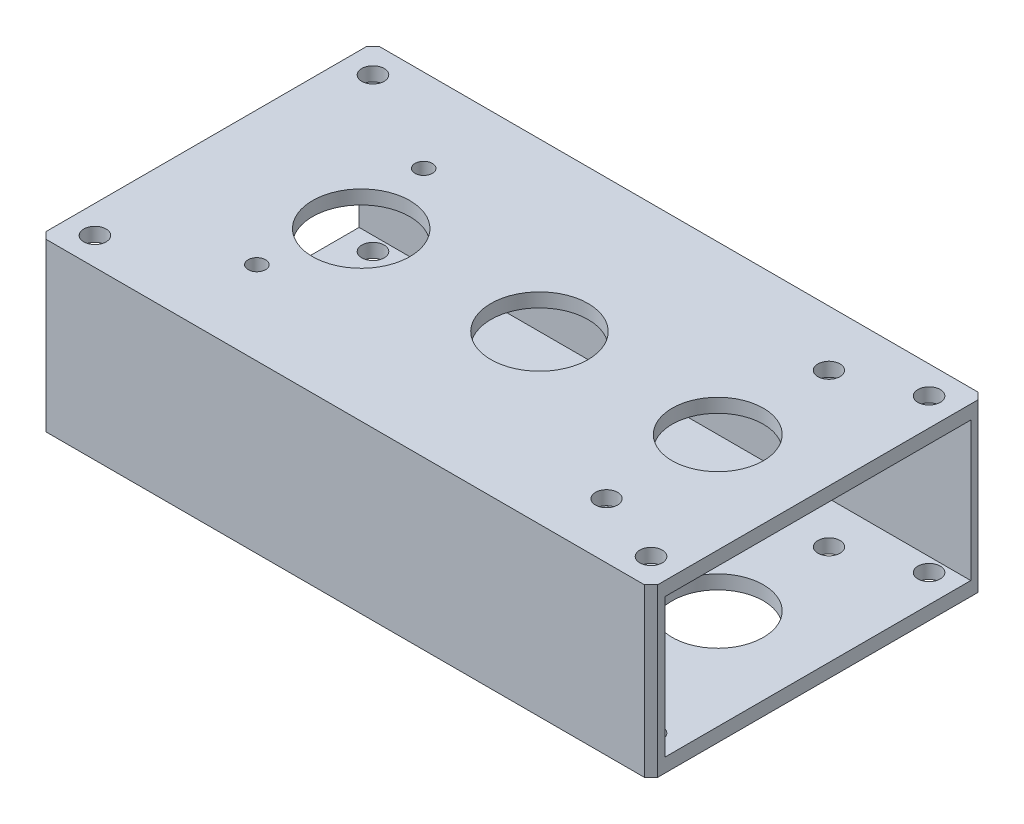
ISO-10303-21;
HEADER;
FILE_DESCRIPTION(('STEP AP214'),'2;1');
FILE_NAME('part.step','',(''),(''),'','','');
FILE_SCHEMA(('AUTOMOTIVE_DESIGN { 1 0 10303 214 1 1 1 1 }'));
ENDSEC;
DATA;
#1=APPLICATION_CONTEXT('core data for automotive mechanical design processes');
#2=APPLICATION_PROTOCOL_DEFINITION('international standard','automotive_design',2000,#1);
#3=PRODUCT_CONTEXT('',#1,'mechanical');
#4=PRODUCT('Part','Part','',(#3));
#5=PRODUCT_RELATED_PRODUCT_CATEGORY('part','',(#4));
#6=PRODUCT_DEFINITION_FORMATION('','',#4);
#7=PRODUCT_DEFINITION_CONTEXT('part definition',#1,'design');
#8=PRODUCT_DEFINITION('design','',#6,#7);
#9=PRODUCT_DEFINITION_SHAPE('','',#8);
#10=(LENGTH_UNIT() NAMED_UNIT(*) SI_UNIT(.MILLI.,.METRE.));
#11=(NAMED_UNIT(*) PLANE_ANGLE_UNIT() SI_UNIT($,.RADIAN.));
#12=(NAMED_UNIT(*) SI_UNIT($,.STERADIAN.) SOLID_ANGLE_UNIT());
#13=UNCERTAINTY_MEASURE_WITH_UNIT(LENGTH_MEASURE(1.E-05),#10,'distance_accuracy_value','');
#14=(GEOMETRIC_REPRESENTATION_CONTEXT(3) GLOBAL_UNCERTAINTY_ASSIGNED_CONTEXT((#13)) GLOBAL_UNIT_ASSIGNED_CONTEXT((#10,
#11,#12)) REPRESENTATION_CONTEXT('',''));
#15=CARTESIAN_POINT('',(0.,0.,0.));
#16=DIRECTION('',(0.,0.,1.));
#17=DIRECTION('',(1.,0.,0.));
#18=AXIS2_PLACEMENT_3D('',#15,#16,#17);
#19=CARTESIAN_POINT('',(30.6324,144.578053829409,-19.05));
#20=DIRECTION('',(0.,1.,0.));
#21=DIRECTION('',(0.,0.,1.));
#22=AXIS2_PLACEMENT_3D('',#19,#20,#21);
#23=CYLINDRICAL_SURFACE('',#22,1.98374);
#24=CARTESIAN_POINT('',(30.6324,-19.05,-19.05));
#25=DIRECTION('',(0.,1.,0.));
#26=DIRECTION('',(0.,0.,1.));
#27=AXIS2_PLACEMENT_3D('',#24,#25,#26);
#28=CIRCLE('',#27,1.98374);
#29=CARTESIAN_POINT('',(30.6324,-19.05,-17.06626));
#30=VERTEX_POINT('',#29);
#31=EDGE_CURVE('E146',#30,#30,#28,.T.);
#32=ORIENTED_EDGE('',*,*,#31,.F.);
#33=EDGE_LOOP('',(#32));
#34=FACE_BOUND('',#33,.T.);
#35=CARTESIAN_POINT('',(30.6324,-15.875,-19.05));
#36=DIRECTION('',(0.,1.,0.));
#37=DIRECTION('',(0.,0.,1.));
#38=AXIS2_PLACEMENT_3D('',#35,#36,#37);
#39=CIRCLE('',#38,1.98374);
#40=CARTESIAN_POINT('',(30.6324,-15.875,-17.06626));
#41=VERTEX_POINT('',#40);
#42=EDGE_CURVE('E20',#41,#41,#39,.T.);
#43=ORIENTED_EDGE('',*,*,#42,.T.);
#44=EDGE_LOOP('',(#43));
#45=FACE_BOUND('',#44,.T.);
#46=ADVANCED_FACE('F17',(#34,#45),#23,.F.);
#47=CARTESIAN_POINT('',(116.84,-144.578053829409,0.));
#48=DIRECTION('',(0.,-1.,0.));
#49=DIRECTION('',(0.,0.,-1.));
#50=AXIS2_PLACEMENT_3D('',#47,#48,#49);
#51=CYLINDRICAL_SURFACE('',#50,10.414);
#52=CARTESIAN_POINT('',(116.84,-19.05,0.));
#53=DIRECTION('',(0.,-1.,0.));
#54=DIRECTION('',(0.,0.,-1.));
#55=AXIS2_PLACEMENT_3D('',#52,#53,#54);
#56=CIRCLE('',#55,10.414);
#57=CARTESIAN_POINT('',(116.84,-19.05,-10.414));
#58=VERTEX_POINT('',#57);
#59=EDGE_CURVE('E241',#58,#58,#56,.F.);
#60=ORIENTED_EDGE('',*,*,#59,.F.);
#61=EDGE_LOOP('',(#60));
#62=FACE_BOUND('',#61,.T.);
#63=CARTESIAN_POINT('',(116.84,-15.875,0.));
#64=DIRECTION('',(0.,-1.,0.));
#65=DIRECTION('',(0.,0.,-1.));
#66=AXIS2_PLACEMENT_3D('',#63,#64,#65);
#67=CIRCLE('',#66,10.414);
#68=CARTESIAN_POINT('',(116.84,-15.875,-10.414));
#69=VERTEX_POINT('',#68);
#70=EDGE_CURVE('E269',#69,#69,#67,.F.);
#71=ORIENTED_EDGE('',*,*,#70,.T.);
#72=EDGE_LOOP('',(#71));
#73=FACE_BOUND('',#72,.T.);
#74=ADVANCED_FACE('F411',(#62,#73),#51,.F.);
#75=CARTESIAN_POINT('',(6.35000000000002,-144.578053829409,31.75));
#76=DIRECTION('',(0.,-1.,0.));
#77=DIRECTION('',(0.,0.,-1.));
#78=AXIS2_PLACEMENT_3D('',#75,#76,#77);
#79=CYLINDRICAL_SURFACE('',#78,2.5527);
#80=CARTESIAN_POINT('',(6.35000000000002,-19.05,31.75));
#81=DIRECTION('',(0.,-1.,0.));
#82=DIRECTION('',(0.,0.,-1.));
#83=AXIS2_PLACEMENT_3D('',#80,#81,#82);
#84=CIRCLE('',#83,2.5527);
#85=CARTESIAN_POINT('',(6.35000000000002,-19.05,29.1973));
#86=VERTEX_POINT('',#85);
#87=EDGE_CURVE('E238',#86,#86,#84,.F.);
#88=ORIENTED_EDGE('',*,*,#87,.F.);
#89=EDGE_LOOP('',(#88));
#90=FACE_BOUND('',#89,.T.);
#91=CARTESIAN_POINT('',(6.35000000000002,-15.875,31.75));
#92=DIRECTION('',(0.,-1.,0.));
#93=DIRECTION('',(0.,0.,-1.));
#94=AXIS2_PLACEMENT_3D('',#91,#92,#93);
#95=CIRCLE('',#94,2.5527);
#96=CARTESIAN_POINT('',(6.35000000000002,-15.875,29.1973));
#97=VERTEX_POINT('',#96);
#98=EDGE_CURVE('E267',#97,#97,#95,.F.);
#99=ORIENTED_EDGE('',*,*,#98,.T.);
#100=EDGE_LOOP('',(#99));
#101=FACE_BOUND('',#100,.T.);
#102=ADVANCED_FACE('F415',(#90,#101),#79,.F.);
#103=CARTESIAN_POINT('',(133.35,-144.578053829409,-31.75));
#104=DIRECTION('',(0.,-1.,0.));
#105=DIRECTION('',(0.,0.,-1.));
#106=AXIS2_PLACEMENT_3D('',#103,#104,#105);
#107=CYLINDRICAL_SURFACE('',#106,2.5527);
#108=CARTESIAN_POINT('',(133.35,-19.05,-31.75));
#109=DIRECTION('',(0.,-1.,0.));
#110=DIRECTION('',(0.,0.,-1.));
#111=AXIS2_PLACEMENT_3D('',#108,#109,#110);
#112=CIRCLE('',#111,2.5527);
#113=CARTESIAN_POINT('',(133.35,-19.05,-34.3027));
#114=VERTEX_POINT('',#113);
#115=EDGE_CURVE('E235',#114,#114,#112,.F.);
#116=ORIENTED_EDGE('',*,*,#115,.F.);
#117=EDGE_LOOP('',(#116));
#118=FACE_BOUND('',#117,.T.);
#119=CARTESIAN_POINT('',(133.35,-15.875,-31.75));
#120=DIRECTION('',(0.,-1.,0.));
#121=DIRECTION('',(0.,0.,-1.));
#122=AXIS2_PLACEMENT_3D('',#119,#120,#121);
#123=CIRCLE('',#122,2.5527);
#124=CARTESIAN_POINT('',(133.35,-15.875,-34.3027));
#125=VERTEX_POINT('',#124);
#126=EDGE_CURVE('E264',#125,#125,#123,.F.);
#127=ORIENTED_EDGE('',*,*,#126,.T.);
#128=EDGE_LOOP('',(#127));
#129=FACE_BOUND('',#128,.T.);
#130=ADVANCED_FACE('F420',(#118,#129),#107,.F.);
#131=CARTESIAN_POINT('',(76.1238,-144.578053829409,0.));
#132=DIRECTION('',(0.,-1.,0.));
#133=DIRECTION('',(0.,0.,-1.));
#134=AXIS2_PLACEMENT_3D('',#131,#132,#133);
#135=CYLINDRICAL_SURFACE('',#134,11.10615);
#136=CARTESIAN_POINT('',(76.1238,-19.05,0.));
#137=DIRECTION('',(0.,-1.,0.));
#138=DIRECTION('',(0.,0.,-1.));
#139=AXIS2_PLACEMENT_3D('',#136,#137,#138);
#140=CIRCLE('',#139,11.10615);
#141=CARTESIAN_POINT('',(76.1238,-19.05,-11.10615));
#142=VERTEX_POINT('',#141);
#143=EDGE_CURVE('E232',#142,#142,#140,.F.);
#144=ORIENTED_EDGE('',*,*,#143,.F.);
#145=EDGE_LOOP('',(#144));
#146=FACE_BOUND('',#145,.T.);
#147=CARTESIAN_POINT('',(76.1238,-15.875,0.));
#148=DIRECTION('',(0.,-1.,0.));
#149=DIRECTION('',(0.,0.,-1.));
#150=AXIS2_PLACEMENT_3D('',#147,#148,#149);
#151=CIRCLE('',#150,11.10615);
#152=CARTESIAN_POINT('',(76.1238,-15.875,-11.10615));
#153=VERTEX_POINT('',#152);
#154=EDGE_CURVE('E261',#153,#153,#151,.F.);
#155=ORIENTED_EDGE('',*,*,#154,.T.);
#156=EDGE_LOOP('',(#155));
#157=FACE_BOUND('',#156,.T.);
#158=ADVANCED_FACE('F426',(#146,#157),#135,.F.);
#159=CARTESIAN_POINT('',(116.84,-144.578053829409,-25.4));
#160=DIRECTION('',(0.,-1.,0.));
#161=DIRECTION('',(0.,0.,-1.));
#162=AXIS2_PLACEMENT_3D('',#159,#160,#161);
#163=CYLINDRICAL_SURFACE('',#162,2.5273);
#164=CARTESIAN_POINT('',(116.84,-19.05,-25.4));
#165=DIRECTION('',(0.,-1.,0.));
#166=DIRECTION('',(0.,0.,-1.));
#167=AXIS2_PLACEMENT_3D('',#164,#165,#166);
#168=CIRCLE('',#167,2.5273);
#169=CARTESIAN_POINT('',(116.84,-19.05,-27.9273));
#170=VERTEX_POINT('',#169);
#171=EDGE_CURVE('E229',#170,#170,#168,.F.);
#172=ORIENTED_EDGE('',*,*,#171,.F.);
#173=EDGE_LOOP('',(#172));
#174=FACE_BOUND('',#173,.T.);
#175=CARTESIAN_POINT('',(116.84,-15.875,-25.4));
#176=DIRECTION('',(0.,-1.,0.));
#177=DIRECTION('',(0.,0.,-1.));
#178=AXIS2_PLACEMENT_3D('',#175,#176,#177);
#179=CIRCLE('',#178,2.5273);
#180=CARTESIAN_POINT('',(116.84,-15.875,-27.9273));
#181=VERTEX_POINT('',#180);
#182=EDGE_CURVE('E150',#181,#181,#179,.F.);
#183=ORIENTED_EDGE('',*,*,#182,.T.);
#184=EDGE_LOOP('',(#183));
#185=FACE_BOUND('',#184,.T.);
#186=ADVANCED_FACE('F430',(#174,#185),#163,.F.);
#187=CARTESIAN_POINT('',(116.84,-144.578053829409,25.4));
#188=DIRECTION('',(0.,-1.,0.));
#189=DIRECTION('',(0.,0.,-1.));
#190=AXIS2_PLACEMENT_3D('',#187,#188,#189);
#191=CYLINDRICAL_SURFACE('',#190,2.5273);
#192=CARTESIAN_POINT('',(116.84,-19.05,25.4));
#193=DIRECTION('',(0.,-1.,0.));
#194=DIRECTION('',(0.,0.,-1.));
#195=AXIS2_PLACEMENT_3D('',#192,#193,#194);
#196=CIRCLE('',#195,2.5273);
#197=CARTESIAN_POINT('',(116.84,-19.05,22.8727));
#198=VERTEX_POINT('',#197);
#199=EDGE_CURVE('E226',#198,#198,#196,.F.);
#200=ORIENTED_EDGE('',*,*,#199,.F.);
#201=EDGE_LOOP('',(#200));
#202=FACE_BOUND('',#201,.T.);
#203=CARTESIAN_POINT('',(116.84,-15.875,25.4));
#204=DIRECTION('',(0.,-1.,0.));
#205=DIRECTION('',(0.,0.,-1.));
#206=AXIS2_PLACEMENT_3D('',#203,#204,#205);
#207=CIRCLE('',#206,2.5273);
#208=CARTESIAN_POINT('',(116.84,-15.875,22.8727));
#209=VERTEX_POINT('',#208);
#210=EDGE_CURVE('E149',#209,#209,#207,.F.);
#211=ORIENTED_EDGE('',*,*,#210,.T.);
#212=EDGE_LOOP('',(#211));
#213=FACE_BOUND('',#212,.T.);
#214=ADVANCED_FACE('F434',(#202,#213),#191,.F.);
#215=CARTESIAN_POINT('',(133.35,-144.578053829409,31.75));
#216=DIRECTION('',(0.,-1.,0.));
#217=DIRECTION('',(0.,0.,-1.));
#218=AXIS2_PLACEMENT_3D('',#215,#216,#217);
#219=CYLINDRICAL_SURFACE('',#218,2.5527);
#220=CARTESIAN_POINT('',(133.35,-19.05,31.75));
#221=DIRECTION('',(0.,-1.,0.));
#222=DIRECTION('',(0.,0.,-1.));
#223=AXIS2_PLACEMENT_3D('',#220,#221,#222);
#224=CIRCLE('',#223,2.5527);
#225=CARTESIAN_POINT('',(133.35,-19.05,29.1973));
#226=VERTEX_POINT('',#225);
#227=EDGE_CURVE('E223',#226,#226,#224,.F.);
#228=ORIENTED_EDGE('',*,*,#227,.F.);
#229=EDGE_LOOP('',(#228));
#230=FACE_BOUND('',#229,.T.);
#231=CARTESIAN_POINT('',(133.35,-15.875,31.75));
#232=DIRECTION('',(0.,-1.,0.));
#233=DIRECTION('',(0.,0.,-1.));
#234=AXIS2_PLACEMENT_3D('',#231,#232,#233);
#235=CIRCLE('',#234,2.5527);
#236=CARTESIAN_POINT('',(133.35,-15.875,29.1973));
#237=VERTEX_POINT('',#236);
#238=EDGE_CURVE('E254',#237,#237,#235,.F.);
#239=ORIENTED_EDGE('',*,*,#238,.T.);
#240=EDGE_LOOP('',(#239));
#241=FACE_BOUND('',#240,.T.);
#242=ADVANCED_FACE('F438',(#230,#241),#219,.F.);
#243=CARTESIAN_POINT('',(6.34999999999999,-144.578053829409,-31.75));
#244=DIRECTION('',(0.,-1.,0.));
#245=DIRECTION('',(0.,0.,-1.));
#246=AXIS2_PLACEMENT_3D('',#243,#244,#245);
#247=CYLINDRICAL_SURFACE('',#246,2.5527);
#248=CARTESIAN_POINT('',(6.34999999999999,-19.05,-31.75));
#249=DIRECTION('',(0.,-1.,0.));
#250=DIRECTION('',(0.,0.,-1.));
#251=AXIS2_PLACEMENT_3D('',#248,#249,#250);
#252=CIRCLE('',#251,2.5527);
#253=CARTESIAN_POINT('',(6.34999999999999,-19.05,-34.3027));
#254=VERTEX_POINT('',#253);
#255=EDGE_CURVE('E220',#254,#254,#252,.F.);
#256=ORIENTED_EDGE('',*,*,#255,.F.);
#257=EDGE_LOOP('',(#256));
#258=FACE_BOUND('',#257,.T.);
#259=CARTESIAN_POINT('',(6.34999999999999,-15.875,-31.75));
#260=DIRECTION('',(0.,-1.,0.));
#261=DIRECTION('',(0.,0.,-1.));
#262=AXIS2_PLACEMENT_3D('',#259,#260,#261);
#263=CIRCLE('',#262,2.5527);
#264=CARTESIAN_POINT('',(6.34999999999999,-15.875,-34.3027));
#265=VERTEX_POINT('',#264);
#266=EDGE_CURVE('E251',#265,#265,#263,.F.);
#267=ORIENTED_EDGE('',*,*,#266,.T.);
#268=EDGE_LOOP('',(#267));
#269=FACE_BOUND('',#268,.T.);
#270=ADVANCED_FACE('F442',(#258,#269),#247,.F.);
#271=CARTESIAN_POINT('',(35.4076,144.578053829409,0.));
#272=DIRECTION('',(0.,1.,0.));
#273=DIRECTION('',(0.,0.,1.));
#274=AXIS2_PLACEMENT_3D('',#271,#272,#273);
#275=CYLINDRICAL_SURFACE('',#274,14.28115);
#276=CARTESIAN_POINT('',(35.4076,-19.05,0.));
#277=DIRECTION('',(0.,1.,0.));
#278=DIRECTION('',(0.,0.,1.));
#279=AXIS2_PLACEMENT_3D('',#276,#277,#278);
#280=CIRCLE('',#279,14.28115);
#281=CARTESIAN_POINT('',(35.4076,-19.05,14.28115));
#282=VERTEX_POINT('',#281);
#283=EDGE_CURVE('E217',#282,#282,#280,.T.);
#284=ORIENTED_EDGE('',*,*,#283,.F.);
#285=EDGE_LOOP('',(#284));
#286=FACE_BOUND('',#285,.T.);
#287=CARTESIAN_POINT('',(35.4076,-15.875,0.));
#288=DIRECTION('',(0.,1.,0.));
#289=DIRECTION('',(0.,0.,1.));
#290=AXIS2_PLACEMENT_3D('',#287,#288,#289);
#291=CIRCLE('',#290,14.28115);
#292=CARTESIAN_POINT('',(35.4076,-15.875,14.28115));
#293=VERTEX_POINT('',#292);
#294=EDGE_CURVE('E248',#293,#293,#291,.T.);
#295=ORIENTED_EDGE('',*,*,#294,.T.);
#296=EDGE_LOOP('',(#295));
#297=FACE_BOUND('',#296,.T.);
#298=ADVANCED_FACE('F446',(#286,#297),#275,.F.);
#299=CARTESIAN_POINT('',(30.6324,144.578053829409,19.05));
#300=DIRECTION('',(0.,1.,0.));
#301=DIRECTION('',(0.,0.,1.));
#302=AXIS2_PLACEMENT_3D('',#299,#300,#301);
#303=CYLINDRICAL_SURFACE('',#302,1.98374);
#304=CARTESIAN_POINT('',(30.6324,-19.05,19.05));
#305=DIRECTION('',(0.,1.,0.));
#306=DIRECTION('',(0.,0.,1.));
#307=AXIS2_PLACEMENT_3D('',#304,#305,#306);
#308=CIRCLE('',#307,1.98374);
#309=CARTESIAN_POINT('',(30.6324,-19.05,21.03374));
#310=VERTEX_POINT('',#309);
#311=EDGE_CURVE('E143',#310,#310,#308,.T.);
#312=ORIENTED_EDGE('',*,*,#311,.F.);
#313=EDGE_LOOP('',(#312));
#314=FACE_BOUND('',#313,.T.);
#315=CARTESIAN_POINT('',(30.6324,-15.875,19.05));
#316=DIRECTION('',(0.,1.,0.));
#317=DIRECTION('',(0.,0.,1.));
#318=AXIS2_PLACEMENT_3D('',#315,#316,#317);
#319=CIRCLE('',#318,1.98374);
#320=CARTESIAN_POINT('',(30.6324,-15.875,21.03374));
#321=VERTEX_POINT('',#320);
#322=EDGE_CURVE('E147',#321,#321,#319,.T.);
#323=ORIENTED_EDGE('',*,*,#322,.T.);
#324=EDGE_LOOP('',(#323));
#325=FACE_BOUND('',#324,.T.);
#326=ADVANCED_FACE('F289',(#314,#325),#303,.F.);
#327=CARTESIAN_POINT('',(139.7,-15.875,34.925));
#328=DIRECTION('',(0.,0.,1.));
#329=DIRECTION('',(0.,-1.,0.));
#330=AXIS2_PLACEMENT_3D('',#327,#328,#329);
#331=PLANE('',#330);
#332=DIRECTION('',(1.,0.,0.));
#333=VECTOR('',#332,1.);
#334=CARTESIAN_POINT('',(139.7,15.875,34.925));
#335=LINE('',#334,#333);
#336=CARTESIAN_POINT('',(0.,15.875,34.925));
#337=VERTEX_POINT('',#336);
#338=CARTESIAN_POINT('',(139.7,15.875,34.925));
#339=VERTEX_POINT('',#338);
#340=EDGE_CURVE('E116',#337,#339,#335,.T.);
#341=ORIENTED_EDGE('',*,*,#340,.T.);
#342=DIRECTION('',(0.,-1.,0.));
#343=VECTOR('',#342,1.);
#344=CARTESIAN_POINT('',(139.7,-19.05,34.925));
#345=LINE('',#344,#343);
#346=CARTESIAN_POINT('',(139.7,-15.875,34.925));
#347=VERTEX_POINT('',#346);
#348=EDGE_CURVE('E620',#339,#347,#345,.T.);
#349=ORIENTED_EDGE('',*,*,#348,.T.);
#350=DIRECTION('',(1.,0.,0.));
#351=VECTOR('',#350,1.);
#352=CARTESIAN_POINT('',(139.7,-15.875,34.925));
#353=LINE('',#352,#351);
#354=CARTESIAN_POINT('',(0.,-15.875,34.925));
#355=VERTEX_POINT('',#354);
#356=EDGE_CURVE('E148',#347,#355,#353,.F.);
#357=ORIENTED_EDGE('',*,*,#356,.T.);
#358=DIRECTION('',(0.,-1.,0.));
#359=VECTOR('',#358,1.);
#360=CARTESIAN_POINT('',(0.,-19.05,34.925));
#361=LINE('',#360,#359);
#362=EDGE_CURVE('E125',#337,#355,#361,.T.);
#363=ORIENTED_EDGE('',*,*,#362,.F.);
#364=EDGE_LOOP('',(#341,#349,#357,#363));
#365=FACE_BOUND('',#364,.T.);
#366=ADVANCED_FACE('F279',(#365),#331,.F.);
#367=CARTESIAN_POINT('',(139.7,-15.875,-34.925));
#368=DIRECTION('',(0.,-1.,0.));
#369=DIRECTION('',(0.,0.,-1.));
#370=AXIS2_PLACEMENT_3D('',#367,#368,#369);
#371=PLANE('',#370);
#372=ORIENTED_EDGE('',*,*,#322,.F.);
#373=EDGE_LOOP('',(#372));
#374=FACE_BOUND('',#373,.T.);
#375=ORIENTED_EDGE('',*,*,#294,.F.);
#376=EDGE_LOOP('',(#375));
#377=FACE_BOUND('',#376,.T.);
#378=ORIENTED_EDGE('',*,*,#266,.F.);
#379=EDGE_LOOP('',(#378));
#380=FACE_BOUND('',#379,.T.);
#381=ORIENTED_EDGE('',*,*,#238,.F.);
#382=EDGE_LOOP('',(#381));
#383=FACE_BOUND('',#382,.T.);
#384=ORIENTED_EDGE('',*,*,#210,.F.);
#385=EDGE_LOOP('',(#384));
#386=FACE_BOUND('',#385,.T.);
#387=ORIENTED_EDGE('',*,*,#356,.F.);
#388=DIRECTION('',(0.,0.,1.));
#389=VECTOR('',#388,1.);
#390=CARTESIAN_POINT('',(139.7,-15.875,38.1));
#391=LINE('',#390,#389);
#392=CARTESIAN_POINT('',(139.7,-15.875,-34.925));
#393=VERTEX_POINT('',#392);
#394=EDGE_CURVE('E617',#347,#393,#391,.F.);
#395=ORIENTED_EDGE('',*,*,#394,.T.);
#396=DIRECTION('',(1.,0.,0.));
#397=VECTOR('',#396,1.);
#398=CARTESIAN_POINT('',(139.7,-15.875,-34.925));
#399=LINE('',#398,#397);
#400=CARTESIAN_POINT('',(0.,-15.875,-34.925));
#401=VERTEX_POINT('',#400);
#402=EDGE_CURVE('E144',#393,#401,#399,.F.);
#403=ORIENTED_EDGE('',*,*,#402,.T.);
#404=DIRECTION('',(0.,0.,1.));
#405=VECTOR('',#404,1.);
#406=CARTESIAN_POINT('',(0.,-15.875,38.1));
#407=LINE('',#406,#405);
#408=EDGE_CURVE('E129',#355,#401,#407,.F.);
#409=ORIENTED_EDGE('',*,*,#408,.F.);
#410=EDGE_LOOP('',(#387,#395,#403,#409));
#411=FACE_BOUND('',#410,.T.);
#412=ORIENTED_EDGE('',*,*,#182,.F.);
#413=EDGE_LOOP('',(#412));
#414=FACE_BOUND('',#413,.T.);
#415=ORIENTED_EDGE('',*,*,#154,.F.);
#416=EDGE_LOOP('',(#415));
#417=FACE_BOUND('',#416,.T.);
#418=ORIENTED_EDGE('',*,*,#126,.F.);
#419=EDGE_LOOP('',(#418));
#420=FACE_BOUND('',#419,.T.);
#421=ORIENTED_EDGE('',*,*,#98,.F.);
#422=EDGE_LOOP('',(#421));
#423=FACE_BOUND('',#422,.T.);
#424=ORIENTED_EDGE('',*,*,#70,.F.);
#425=EDGE_LOOP('',(#424));
#426=FACE_BOUND('',#425,.T.);
#427=ORIENTED_EDGE('',*,*,#42,.F.);
#428=EDGE_LOOP('',(#427));
#429=FACE_BOUND('',#428,.T.);
#430=ADVANCED_FACE('F277',(#374,#377,#380,#383,#386,#411,#414,#417,#420,#423,#426,#429),#371,.F.);
#431=CARTESIAN_POINT('',(139.7,15.875,-34.925));
#432=DIRECTION('',(0.,0.,-1.));
#433=DIRECTION('',(0.,1.,0.));
#434=AXIS2_PLACEMENT_3D('',#431,#432,#433);
#435=PLANE('',#434);
#436=ORIENTED_EDGE('',*,*,#402,.F.);
#437=DIRECTION('',(0.,-1.,0.));
#438=VECTOR('',#437,1.);
#439=CARTESIAN_POINT('',(139.7,-19.05,-34.925));
#440=LINE('',#439,#438);
#441=CARTESIAN_POINT('',(139.7,15.875,-34.925));
#442=VERTEX_POINT('',#441);
#443=EDGE_CURVE('E111',#393,#442,#440,.F.);
#444=ORIENTED_EDGE('',*,*,#443,.T.);
#445=DIRECTION('',(1.,0.,0.));
#446=VECTOR('',#445,1.);
#447=CARTESIAN_POINT('',(139.7,15.875,-34.925));
#448=LINE('',#447,#446);
#449=CARTESIAN_POINT('',(0.,15.875,-34.925));
#450=VERTEX_POINT('',#449);
#451=EDGE_CURVE('E103',#442,#450,#448,.F.);
#452=ORIENTED_EDGE('',*,*,#451,.T.);
#453=DIRECTION('',(0.,-1.,0.));
#454=VECTOR('',#453,1.);
#455=CARTESIAN_POINT('',(0.,-19.05,-34.925));
#456=LINE('',#455,#454);
#457=EDGE_CURVE('E108',#401,#450,#456,.F.);
#458=ORIENTED_EDGE('',*,*,#457,.F.);
#459=EDGE_LOOP('',(#436,#444,#452,#458));
#460=FACE_BOUND('',#459,.T.);
#461=ADVANCED_FACE('F106',(#460),#435,.F.);
#462=CARTESIAN_POINT('',(139.7,-19.05,-38.1));
#463=DIRECTION('',(0.,-1.,0.));
#464=DIRECTION('',(0.,0.,-1.));
#465=AXIS2_PLACEMENT_3D('',#462,#463,#464);
#466=PLANE('',#465);
#467=ORIENTED_EDGE('',*,*,#311,.T.);
#468=EDGE_LOOP('',(#467));
#469=FACE_BOUND('',#468,.T.);
#470=ORIENTED_EDGE('',*,*,#283,.T.);
#471=EDGE_LOOP('',(#470));
#472=FACE_BOUND('',#471,.T.);
#473=ORIENTED_EDGE('',*,*,#255,.T.);
#474=EDGE_LOOP('',(#473));
#475=FACE_BOUND('',#474,.T.);
#476=ORIENTED_EDGE('',*,*,#227,.T.);
#477=EDGE_LOOP('',(#476));
#478=FACE_BOUND('',#477,.T.);
#479=ORIENTED_EDGE('',*,*,#199,.T.);
#480=EDGE_LOOP('',(#479));
#481=FACE_BOUND('',#480,.T.);
#482=DIRECTION('',(1.,0.,0.));
#483=VECTOR('',#482,1.);
#484=CARTESIAN_POINT('',(139.7,-19.05,38.1));
#485=LINE('',#484,#483);
#486=CARTESIAN_POINT('',(1.52400000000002,-19.05,38.1));
#487=VERTEX_POINT('',#486);
#488=CARTESIAN_POINT('',(138.176,-19.05,38.1));
#489=VERTEX_POINT('',#488);
#490=EDGE_CURVE('E396',#487,#489,#485,.T.);
#491=ORIENTED_EDGE('',*,*,#490,.F.);
#492=DIRECTION('',(-0.707106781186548,0.,-0.707106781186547));
#493=VECTOR('',#492,1.);
#494=CARTESIAN_POINT('',(0.,-19.05,36.576));
#495=LINE('',#494,#493);
#496=CARTESIAN_POINT('',(0.,-19.05,36.576));
#497=VERTEX_POINT('',#496);
#498=EDGE_CURVE('E638',#487,#497,#495,.T.);
#499=ORIENTED_EDGE('',*,*,#498,.T.);
#500=DIRECTION('',(0.,0.,1.));
#501=VECTOR('',#500,1.);
#502=CARTESIAN_POINT('',(0.,-19.05,38.1));
#503=LINE('',#502,#501);
#504=CARTESIAN_POINT('',(0.,-19.05,-36.576));
#505=VERTEX_POINT('',#504);
#506=EDGE_CURVE('E642',#505,#497,#503,.T.);
#507=ORIENTED_EDGE('',*,*,#506,.F.);
#508=DIRECTION('',(0.707106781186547,0.,-0.707106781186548));
#509=VECTOR('',#508,1.);
#510=CARTESIAN_POINT('',(0.,-19.05,-36.576));
#511=LINE('',#510,#509);
#512=CARTESIAN_POINT('',(1.524,-19.05,-38.1));
#513=VERTEX_POINT('',#512);
#514=EDGE_CURVE('E132',#505,#513,#511,.T.);
#515=ORIENTED_EDGE('',*,*,#514,.T.);
#516=DIRECTION('',(1.,0.,0.));
#517=VECTOR('',#516,1.);
#518=CARTESIAN_POINT('',(139.7,-19.05,-38.1));
#519=LINE('',#518,#517);
#520=CARTESIAN_POINT('',(138.176,-19.05,-38.1));
#521=VERTEX_POINT('',#520);
#522=EDGE_CURVE('E138',#521,#513,#519,.F.);
#523=ORIENTED_EDGE('',*,*,#522,.F.);
#524=DIRECTION('',(-0.707106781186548,0.,-0.707106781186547));
#525=VECTOR('',#524,1.);
#526=CARTESIAN_POINT('',(138.176,-19.05,-38.1));
#527=LINE('',#526,#525);
#528=CARTESIAN_POINT('',(139.7,-19.05,-36.576));
#529=VERTEX_POINT('',#528);
#530=EDGE_CURVE('E674',#529,#521,#527,.T.);
#531=ORIENTED_EDGE('',*,*,#530,.F.);
#532=DIRECTION('',(0.,0.,1.));
#533=VECTOR('',#532,1.);
#534=CARTESIAN_POINT('',(139.7,-19.05,38.1));
#535=LINE('',#534,#533);
#536=CARTESIAN_POINT('',(139.7,-19.05,36.576));
#537=VERTEX_POINT('',#536);
#538=EDGE_CURVE('E678',#529,#537,#535,.T.);
#539=ORIENTED_EDGE('',*,*,#538,.T.);
#540=DIRECTION('',(0.707106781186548,0.,-0.707106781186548));
#541=VECTOR('',#540,1.);
#542=CARTESIAN_POINT('',(138.176,-19.05,38.1));
#543=LINE('',#542,#541);
#544=EDGE_CURVE('E632',#489,#537,#543,.T.);
#545=ORIENTED_EDGE('',*,*,#544,.F.);
#546=EDGE_LOOP('',(#491,#499,#507,#515,#523,#531,#539,#545));
#547=FACE_BOUND('',#546,.T.);
#548=ORIENTED_EDGE('',*,*,#171,.T.);
#549=EDGE_LOOP('',(#548));
#550=FACE_BOUND('',#549,.T.);
#551=ORIENTED_EDGE('',*,*,#143,.T.);
#552=EDGE_LOOP('',(#551));
#553=FACE_BOUND('',#552,.T.);
#554=ORIENTED_EDGE('',*,*,#115,.T.);
#555=EDGE_LOOP('',(#554));
#556=FACE_BOUND('',#555,.T.);
#557=ORIENTED_EDGE('',*,*,#87,.T.);
#558=EDGE_LOOP('',(#557));
#559=FACE_BOUND('',#558,.T.);
#560=ORIENTED_EDGE('',*,*,#59,.T.);
#561=EDGE_LOOP('',(#560));
#562=FACE_BOUND('',#561,.T.);
#563=ORIENTED_EDGE('',*,*,#31,.T.);
#564=EDGE_LOOP('',(#563));
#565=FACE_BOUND('',#564,.T.);
#566=ADVANCED_FACE('F287',(#469,#472,#475,#478,#481,#547,#550,#553,#556,#559,#562,#565),#466,.T.);
#567=CARTESIAN_POINT('',(139.7,15.875,34.925));
#568=DIRECTION('',(0.,1.,0.));
#569=DIRECTION('',(0.,0.,1.));
#570=AXIS2_PLACEMENT_3D('',#567,#568,#569);
#571=PLANE('',#570);
#572=CARTESIAN_POINT('',(6.34999999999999,15.875,-31.75));
#573=DIRECTION('',(0.,-1.,0.));
#574=DIRECTION('',(0.,0.,-1.));
#575=AXIS2_PLACEMENT_3D('',#572,#573,#574);
#576=CIRCLE('',#575,2.5527);
#577=CARTESIAN_POINT('',(6.34999999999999,15.875,-34.3027));
#578=VERTEX_POINT('',#577);
#579=EDGE_CURVE('E183',#578,#578,#576,.F.);
#580=ORIENTED_EDGE('',*,*,#579,.T.);
#581=EDGE_LOOP('',(#580));
#582=FACE_BOUND('',#581,.T.);
#583=CARTESIAN_POINT('',(133.35,15.875,31.75));
#584=DIRECTION('',(0.,-1.,0.));
#585=DIRECTION('',(0.,0.,-1.));
#586=AXIS2_PLACEMENT_3D('',#583,#584,#585);
#587=CIRCLE('',#586,2.5527);
#588=CARTESIAN_POINT('',(133.35,15.875,29.1973));
#589=VERTEX_POINT('',#588);
#590=EDGE_CURVE('E186',#589,#589,#587,.F.);
#591=ORIENTED_EDGE('',*,*,#590,.T.);
#592=EDGE_LOOP('',(#591));
#593=FACE_BOUND('',#592,.T.);
#594=CARTESIAN_POINT('',(116.84,15.875,25.4));
#595=DIRECTION('',(0.,-1.,0.));
#596=DIRECTION('',(0.,0.,-1.));
#597=AXIS2_PLACEMENT_3D('',#594,#595,#596);
#598=CIRCLE('',#597,2.5273);
#599=CARTESIAN_POINT('',(116.84,15.875,22.8727));
#600=VERTEX_POINT('',#599);
#601=EDGE_CURVE('E189',#600,#600,#598,.F.);
#602=ORIENTED_EDGE('',*,*,#601,.T.);
#603=EDGE_LOOP('',(#602));
#604=FACE_BOUND('',#603,.T.);
#605=ORIENTED_EDGE('',*,*,#451,.F.);
#606=DIRECTION('',(0.,0.,1.));
#607=VECTOR('',#606,1.);
#608=CARTESIAN_POINT('',(139.7,15.875,38.1));
#609=LINE('',#608,#607);
#610=EDGE_CURVE('E624',#442,#339,#609,.T.);
#611=ORIENTED_EDGE('',*,*,#610,.T.);
#612=ORIENTED_EDGE('',*,*,#340,.F.);
#613=DIRECTION('',(0.,0.,1.));
#614=VECTOR('',#613,1.);
#615=CARTESIAN_POINT('',(0.,15.875,38.1));
#616=LINE('',#615,#614);
#617=EDGE_CURVE('E119',#450,#337,#616,.T.);
#618=ORIENTED_EDGE('',*,*,#617,.F.);
#619=EDGE_LOOP('',(#605,#611,#612,#618));
#620=FACE_BOUND('',#619,.T.);
#621=CARTESIAN_POINT('',(116.84,15.875,-25.4));
#622=DIRECTION('',(0.,-1.,0.));
#623=DIRECTION('',(0.,0.,-1.));
#624=AXIS2_PLACEMENT_3D('',#621,#622,#623);
#625=CIRCLE('',#624,2.5273);
#626=CARTESIAN_POINT('',(116.84,15.875,-27.9273));
#627=VERTEX_POINT('',#626);
#628=EDGE_CURVE('E140',#627,#627,#625,.F.);
#629=ORIENTED_EDGE('',*,*,#628,.T.);
#630=EDGE_LOOP('',(#629));
#631=FACE_BOUND('',#630,.T.);
#632=CARTESIAN_POINT('',(76.1238,15.875,0.));
#633=DIRECTION('',(0.,-1.,0.));
#634=DIRECTION('',(0.,0.,-1.));
#635=AXIS2_PLACEMENT_3D('',#632,#633,#634);
#636=CIRCLE('',#635,11.10615);
#637=CARTESIAN_POINT('',(76.1238,15.875,-11.10615));
#638=VERTEX_POINT('',#637);
#639=EDGE_CURVE('E195',#638,#638,#636,.F.);
#640=ORIENTED_EDGE('',*,*,#639,.T.);
#641=EDGE_LOOP('',(#640));
#642=FACE_BOUND('',#641,.T.);
#643=CARTESIAN_POINT('',(133.35,15.875,-31.75));
#644=DIRECTION('',(0.,-1.,0.));
#645=DIRECTION('',(0.,0.,-1.));
#646=AXIS2_PLACEMENT_3D('',#643,#644,#645);
#647=CIRCLE('',#646,2.5527);
#648=CARTESIAN_POINT('',(133.35,15.875,-34.3027));
#649=VERTEX_POINT('',#648);
#650=EDGE_CURVE('E198',#649,#649,#647,.F.);
#651=ORIENTED_EDGE('',*,*,#650,.T.);
#652=EDGE_LOOP('',(#651));
#653=FACE_BOUND('',#652,.T.);
#654=CARTESIAN_POINT('',(6.35000000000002,15.875,31.75));
#655=DIRECTION('',(0.,-1.,0.));
#656=DIRECTION('',(0.,0.,-1.));
#657=AXIS2_PLACEMENT_3D('',#654,#655,#656);
#658=CIRCLE('',#657,2.5527);
#659=CARTESIAN_POINT('',(6.35000000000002,15.875,29.1973));
#660=VERTEX_POINT('',#659);
#661=EDGE_CURVE('E201',#660,#660,#658,.F.);
#662=ORIENTED_EDGE('',*,*,#661,.T.);
#663=EDGE_LOOP('',(#662));
#664=FACE_BOUND('',#663,.T.);
#665=CARTESIAN_POINT('',(116.84,15.875,0.));
#666=DIRECTION('',(0.,-1.,0.));
#667=DIRECTION('',(0.,0.,-1.));
#668=AXIS2_PLACEMENT_3D('',#665,#666,#667);
#669=CIRCLE('',#668,10.414);
#670=CARTESIAN_POINT('',(116.84,15.875,-10.414));
#671=VERTEX_POINT('',#670);
#672=EDGE_CURVE('E204',#671,#671,#669,.F.);
#673=ORIENTED_EDGE('',*,*,#672,.T.);
#674=EDGE_LOOP('',(#673));
#675=FACE_BOUND('',#674,.T.);
#676=CARTESIAN_POINT('',(35.4076,15.875,0.));
#677=DIRECTION('',(0.,-1.,0.));
#678=DIRECTION('',(0.,0.,-1.));
#679=AXIS2_PLACEMENT_3D('',#676,#677,#678);
#680=CIRCLE('',#679,11.10615);
#681=CARTESIAN_POINT('',(35.4076,15.875,-11.10615));
#682=VERTEX_POINT('',#681);
#683=EDGE_CURVE('E207',#682,#682,#680,.F.);
#684=ORIENTED_EDGE('',*,*,#683,.T.);
#685=EDGE_LOOP('',(#684));
#686=FACE_BOUND('',#685,.T.);
#687=CARTESIAN_POINT('',(30.6324,15.875,19.05));
#688=DIRECTION('',(0.,-1.,0.));
#689=DIRECTION('',(0.,0.,-1.));
#690=AXIS2_PLACEMENT_3D('',#687,#688,#689);
#691=CIRCLE('',#690,1.98374);
#692=CARTESIAN_POINT('',(30.6324,15.875,17.06626));
#693=VERTEX_POINT('',#692);
#694=EDGE_CURVE('E210',#693,#693,#691,.F.);
#695=ORIENTED_EDGE('',*,*,#694,.T.);
#696=EDGE_LOOP('',(#695));
#697=FACE_BOUND('',#696,.T.);
#698=CARTESIAN_POINT('',(30.6324,15.875,-19.05));
#699=DIRECTION('',(0.,-1.,0.));
#700=DIRECTION('',(0.,0.,-1.));
#701=AXIS2_PLACEMENT_3D('',#698,#699,#700);
#702=CIRCLE('',#701,1.98374);
#703=CARTESIAN_POINT('',(30.6324,15.875,-21.03374));
#704=VERTEX_POINT('',#703);
#705=EDGE_CURVE('E115',#704,#704,#702,.F.);
#706=ORIENTED_EDGE('',*,*,#705,.T.);
#707=EDGE_LOOP('',(#706));
#708=FACE_BOUND('',#707,.T.);
#709=ADVANCED_FACE('F120',(#582,#593,#604,#620,#631,#642,#653,#664,#675,#686,#697,#708),#571,.F.);
#710=CARTESIAN_POINT('',(30.6324,-144.578053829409,-19.05));
#711=DIRECTION('',(0.,-1.,0.));
#712=DIRECTION('',(0.,0.,-1.));
#713=AXIS2_PLACEMENT_3D('',#710,#711,#712);
#714=CYLINDRICAL_SURFACE('',#713,1.98374);
#715=CARTESIAN_POINT('',(30.6324,19.05,-19.05));
#716=DIRECTION('',(0.,-1.,0.));
#717=DIRECTION('',(0.,0.,-1.));
#718=AXIS2_PLACEMENT_3D('',#715,#716,#717);
#719=CIRCLE('',#718,1.98374);
#720=CARTESIAN_POINT('',(30.6324,19.05,-21.03374));
#721=VERTEX_POINT('',#720);
#722=EDGE_CURVE('E180',#721,#721,#719,.T.);
#723=ORIENTED_EDGE('',*,*,#722,.F.);
#724=EDGE_LOOP('',(#723));
#725=FACE_BOUND('',#724,.T.);
#726=ORIENTED_EDGE('',*,*,#705,.F.);
#727=EDGE_LOOP('',(#726));
#728=FACE_BOUND('',#727,.T.);
#729=ADVANCED_FACE('F371',(#725,#728),#714,.F.);
#730=CARTESIAN_POINT('',(30.6324,-144.578053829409,19.05));
#731=DIRECTION('',(0.,-1.,0.));
#732=DIRECTION('',(0.,0.,-1.));
#733=AXIS2_PLACEMENT_3D('',#730,#731,#732);
#734=CYLINDRICAL_SURFACE('',#733,1.98374);
#735=CARTESIAN_POINT('',(30.6324,19.05,19.05));
#736=DIRECTION('',(0.,-1.,0.));
#737=DIRECTION('',(0.,0.,-1.));
#738=AXIS2_PLACEMENT_3D('',#735,#736,#737);
#739=CIRCLE('',#738,1.98374);
#740=CARTESIAN_POINT('',(30.6324,19.05,17.06626));
#741=VERTEX_POINT('',#740);
#742=EDGE_CURVE('E177',#741,#741,#739,.T.);
#743=ORIENTED_EDGE('',*,*,#742,.F.);
#744=EDGE_LOOP('',(#743));
#745=FACE_BOUND('',#744,.T.);
#746=ORIENTED_EDGE('',*,*,#694,.F.);
#747=EDGE_LOOP('',(#746));
#748=FACE_BOUND('',#747,.T.);
#749=ADVANCED_FACE('F367',(#745,#748),#734,.F.);
#750=CARTESIAN_POINT('',(35.4076,-144.578053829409,0.));
#751=DIRECTION('',(0.,-1.,0.));
#752=DIRECTION('',(0.,0.,-1.));
#753=AXIS2_PLACEMENT_3D('',#750,#751,#752);
#754=CYLINDRICAL_SURFACE('',#753,11.10615);
#755=CARTESIAN_POINT('',(35.4076,19.05,0.));
#756=DIRECTION('',(0.,-1.,0.));
#757=DIRECTION('',(0.,0.,-1.));
#758=AXIS2_PLACEMENT_3D('',#755,#756,#757);
#759=CIRCLE('',#758,11.10615);
#760=CARTESIAN_POINT('',(35.4076,19.05,-11.10615));
#761=VERTEX_POINT('',#760);
#762=EDGE_CURVE('E174',#761,#761,#759,.T.);
#763=ORIENTED_EDGE('',*,*,#762,.F.);
#764=EDGE_LOOP('',(#763));
#765=FACE_BOUND('',#764,.T.);
#766=ORIENTED_EDGE('',*,*,#683,.F.);
#767=EDGE_LOOP('',(#766));
#768=FACE_BOUND('',#767,.T.);
#769=ADVANCED_FACE('F363',(#765,#768),#754,.F.);
#770=CARTESIAN_POINT('',(116.84,-144.578053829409,0.));
#771=DIRECTION('',(0.,-1.,0.));
#772=DIRECTION('',(0.,0.,-1.));
#773=AXIS2_PLACEMENT_3D('',#770,#771,#772);
#774=CYLINDRICAL_SURFACE('',#773,10.414);
#775=CARTESIAN_POINT('',(116.84,19.05,0.));
#776=DIRECTION('',(0.,-1.,0.));
#777=DIRECTION('',(0.,0.,-1.));
#778=AXIS2_PLACEMENT_3D('',#775,#776,#777);
#779=CIRCLE('',#778,10.414);
#780=CARTESIAN_POINT('',(116.84,19.05,-10.414));
#781=VERTEX_POINT('',#780);
#782=EDGE_CURVE('E171',#781,#781,#779,.T.);
#783=ORIENTED_EDGE('',*,*,#782,.F.);
#784=EDGE_LOOP('',(#783));
#785=FACE_BOUND('',#784,.T.);
#786=ORIENTED_EDGE('',*,*,#672,.F.);
#787=EDGE_LOOP('',(#786));
#788=FACE_BOUND('',#787,.T.);
#789=ADVANCED_FACE('F359',(#785,#788),#774,.F.);
#790=CARTESIAN_POINT('',(6.35000000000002,-144.578053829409,31.75));
#791=DIRECTION('',(0.,-1.,0.));
#792=DIRECTION('',(0.,0.,-1.));
#793=AXIS2_PLACEMENT_3D('',#790,#791,#792);
#794=CYLINDRICAL_SURFACE('',#793,2.5527);
#795=CARTESIAN_POINT('',(6.35000000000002,19.05,31.75));
#796=DIRECTION('',(0.,-1.,0.));
#797=DIRECTION('',(0.,0.,-1.));
#798=AXIS2_PLACEMENT_3D('',#795,#796,#797);
#799=CIRCLE('',#798,2.5527);
#800=CARTESIAN_POINT('',(6.35000000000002,19.05,29.1973));
#801=VERTEX_POINT('',#800);
#802=EDGE_CURVE('E168',#801,#801,#799,.T.);
#803=ORIENTED_EDGE('',*,*,#802,.F.);
#804=EDGE_LOOP('',(#803));
#805=FACE_BOUND('',#804,.T.);
#806=ORIENTED_EDGE('',*,*,#661,.F.);
#807=EDGE_LOOP('',(#806));
#808=FACE_BOUND('',#807,.T.);
#809=ADVANCED_FACE('F355',(#805,#808),#794,.F.);
#810=CARTESIAN_POINT('',(133.35,-144.578053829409,-31.75));
#811=DIRECTION('',(0.,-1.,0.));
#812=DIRECTION('',(0.,0.,-1.));
#813=AXIS2_PLACEMENT_3D('',#810,#811,#812);
#814=CYLINDRICAL_SURFACE('',#813,2.5527);
#815=CARTESIAN_POINT('',(133.35,19.05,-31.75));
#816=DIRECTION('',(0.,-1.,0.));
#817=DIRECTION('',(0.,0.,-1.));
#818=AXIS2_PLACEMENT_3D('',#815,#816,#817);
#819=CIRCLE('',#818,2.5527);
#820=CARTESIAN_POINT('',(133.35,19.05,-34.3027));
#821=VERTEX_POINT('',#820);
#822=EDGE_CURVE('E165',#821,#821,#819,.T.);
#823=ORIENTED_EDGE('',*,*,#822,.F.);
#824=EDGE_LOOP('',(#823));
#825=FACE_BOUND('',#824,.T.);
#826=ORIENTED_EDGE('',*,*,#650,.F.);
#827=EDGE_LOOP('',(#826));
#828=FACE_BOUND('',#827,.T.);
#829=ADVANCED_FACE('F351',(#825,#828),#814,.F.);
#830=CARTESIAN_POINT('',(76.1238,-144.578053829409,0.));
#831=DIRECTION('',(0.,-1.,0.));
#832=DIRECTION('',(0.,0.,-1.));
#833=AXIS2_PLACEMENT_3D('',#830,#831,#832);
#834=CYLINDRICAL_SURFACE('',#833,11.10615);
#835=CARTESIAN_POINT('',(76.1238,19.05,0.));
#836=DIRECTION('',(0.,-1.,0.));
#837=DIRECTION('',(0.,0.,-1.));
#838=AXIS2_PLACEMENT_3D('',#835,#836,#837);
#839=CIRCLE('',#838,11.10615);
#840=CARTESIAN_POINT('',(76.1238,19.05,-11.10615));
#841=VERTEX_POINT('',#840);
#842=EDGE_CURVE('E162',#841,#841,#839,.T.);
#843=ORIENTED_EDGE('',*,*,#842,.F.);
#844=EDGE_LOOP('',(#843));
#845=FACE_BOUND('',#844,.T.);
#846=ORIENTED_EDGE('',*,*,#639,.F.);
#847=EDGE_LOOP('',(#846));
#848=FACE_BOUND('',#847,.T.);
#849=ADVANCED_FACE('F347',(#845,#848),#834,.F.);
#850=CARTESIAN_POINT('',(116.84,-144.578053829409,-25.4));
#851=DIRECTION('',(0.,-1.,0.));
#852=DIRECTION('',(0.,0.,-1.));
#853=AXIS2_PLACEMENT_3D('',#850,#851,#852);
#854=CYLINDRICAL_SURFACE('',#853,2.5273);
#855=CARTESIAN_POINT('',(116.84,19.05,-25.4));
#856=DIRECTION('',(0.,-1.,0.));
#857=DIRECTION('',(0.,0.,-1.));
#858=AXIS2_PLACEMENT_3D('',#855,#856,#857);
#859=CIRCLE('',#858,2.5273);
#860=CARTESIAN_POINT('',(116.84,19.05,-27.9273));
#861=VERTEX_POINT('',#860);
#862=EDGE_CURVE('E158',#861,#861,#859,.T.);
#863=ORIENTED_EDGE('',*,*,#862,.F.);
#864=EDGE_LOOP('',(#863));
#865=FACE_BOUND('',#864,.T.);
#866=ORIENTED_EDGE('',*,*,#628,.F.);
#867=EDGE_LOOP('',(#866));
#868=FACE_BOUND('',#867,.T.);
#869=ADVANCED_FACE('F343',(#865,#868),#854,.F.);
#870=CARTESIAN_POINT('',(139.7,19.05,-38.1));
#871=DIRECTION('',(0.,0.,-1.));
#872=DIRECTION('',(0.,1.,0.));
#873=AXIS2_PLACEMENT_3D('',#870,#871,#872);
#874=PLANE('',#873);
#875=DIRECTION('',(1.,0.,0.));
#876=VECTOR('',#875,1.);
#877=CARTESIAN_POINT('',(139.7,19.05,-38.1));
#878=LINE('',#877,#876);
#879=CARTESIAN_POINT('',(138.176,19.05,-38.1));
#880=VERTEX_POINT('',#879);
#881=CARTESIAN_POINT('',(1.524,19.05,-38.1));
#882=VERTEX_POINT('',#881);
#883=EDGE_CURVE('E161',#880,#882,#878,.F.);
#884=ORIENTED_EDGE('',*,*,#883,.F.);
#885=DIRECTION('',(0.,1.,0.));
#886=VECTOR('',#885,1.);
#887=CARTESIAN_POINT('',(138.176,19.05,-38.1));
#888=LINE('',#887,#886);
#889=EDGE_CURVE('E192',#521,#880,#888,.T.);
#890=ORIENTED_EDGE('',*,*,#889,.F.);
#891=ORIENTED_EDGE('',*,*,#522,.T.);
#892=DIRECTION('',(0.,1.,0.));
#893=VECTOR('',#892,1.);
#894=CARTESIAN_POINT('',(1.524,-19.05,-38.1));
#895=LINE('',#894,#893);
#896=EDGE_CURVE('E130',#513,#882,#895,.T.);
#897=ORIENTED_EDGE('',*,*,#896,.T.);
#898=EDGE_LOOP('',(#884,#890,#891,#897));
#899=FACE_BOUND('',#898,.T.);
#900=ADVANCED_FACE('F339',(#899),#874,.T.);
#901=CARTESIAN_POINT('',(0.,-19.05,-36.576));
#902=DIRECTION('',(0.707106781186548,0.,0.707106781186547));
#903=DIRECTION('',(0.707106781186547,0.,-0.707106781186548));
#904=AXIS2_PLACEMENT_3D('',#901,#902,#903);
#905=PLANE('',#904);
#906=ORIENTED_EDGE('',*,*,#896,.F.);
#907=ORIENTED_EDGE('',*,*,#514,.F.);
#908=DIRECTION('',(0.,-1.,0.));
#909=VECTOR('',#908,1.);
#910=CARTESIAN_POINT('',(0.,-19.05,-36.576));
#911=LINE('',#910,#909);
#912=CARTESIAN_POINT('',(0.,19.05,-36.576));
#913=VERTEX_POINT('',#912);
#914=EDGE_CURVE('E644',#913,#505,#911,.T.);
#915=ORIENTED_EDGE('',*,*,#914,.F.);
#916=DIRECTION('',(-0.707106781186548,0.,0.707106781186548));
#917=VECTOR('',#916,1.);
#918=CARTESIAN_POINT('',(1.524,19.05,-38.1));
#919=LINE('',#918,#917);
#920=EDGE_CURVE('E654',#882,#913,#919,.T.);
#921=ORIENTED_EDGE('',*,*,#920,.F.);
#922=EDGE_LOOP('',(#906,#907,#915,#921));
#923=FACE_BOUND('',#922,.T.);
#924=ADVANCED_FACE('F335',(#923),#905,.F.);
#925=CARTESIAN_POINT('',(0.,-19.05,38.1));
#926=DIRECTION('',(-1.,0.,0.));
#927=DIRECTION('',(0.,-1.,0.));
#928=AXIS2_PLACEMENT_3D('',#925,#926,#927);
#929=PLANE('',#928);
#930=ORIENTED_EDGE('',*,*,#506,.T.);
#931=DIRECTION('',(0.,1.,0.));
#932=VECTOR('',#931,1.);
#933=CARTESIAN_POINT('',(0.,-19.05,36.576));
#934=LINE('',#933,#932);
#935=CARTESIAN_POINT('',(0.,19.05,36.576));
#936=VERTEX_POINT('',#935);
#937=EDGE_CURVE('E640',#497,#936,#934,.T.);
#938=ORIENTED_EDGE('',*,*,#937,.T.);
#939=DIRECTION('',(0.,0.,1.));
#940=VECTOR('',#939,1.);
#941=CARTESIAN_POINT('',(0.,19.05,38.1));
#942=LINE('',#941,#940);
#943=EDGE_CURVE('E650',#913,#936,#942,.T.);
#944=ORIENTED_EDGE('',*,*,#943,.F.);
#945=ORIENTED_EDGE('',*,*,#914,.T.);
#946=EDGE_LOOP('',(#930,#938,#944,#945));
#947=FACE_BOUND('',#946,.T.);
#948=ORIENTED_EDGE('',*,*,#362,.T.);
#949=ORIENTED_EDGE('',*,*,#408,.T.);
#950=ORIENTED_EDGE('',*,*,#457,.T.);
#951=ORIENTED_EDGE('',*,*,#617,.T.);
#952=EDGE_LOOP('',(#948,#949,#950,#951));
#953=FACE_BOUND('',#952,.T.);
#954=ADVANCED_FACE('F127',(#947,#953),#929,.T.);
#955=CARTESIAN_POINT('',(0.,-19.05,36.576));
#956=DIRECTION('',(0.707106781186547,0.,-0.707106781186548));
#957=DIRECTION('',(-0.707106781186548,0.,-0.707106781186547));
#958=AXIS2_PLACEMENT_3D('',#955,#956,#957);
#959=PLANE('',#958);
#960=DIRECTION('',(0.,-1.,0.));
#961=VECTOR('',#960,1.);
#962=CARTESIAN_POINT('',(1.524,-19.05,38.1));
#963=LINE('',#962,#961);
#964=CARTESIAN_POINT('',(1.524,19.05,38.1));
#965=VERTEX_POINT('',#964);
#966=EDGE_CURVE('E634',#965,#487,#963,.T.);
#967=ORIENTED_EDGE('',*,*,#966,.F.);
#968=DIRECTION('',(0.707106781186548,0.,0.707106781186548));
#969=VECTOR('',#968,1.);
#970=CARTESIAN_POINT('',(0.,19.05,36.576));
#971=LINE('',#970,#969);
#972=EDGE_CURVE('E659',#936,#965,#971,.T.);
#973=ORIENTED_EDGE('',*,*,#972,.F.);
#974=ORIENTED_EDGE('',*,*,#937,.F.);
#975=ORIENTED_EDGE('',*,*,#498,.F.);
#976=EDGE_LOOP('',(#967,#973,#974,#975));
#977=FACE_BOUND('',#976,.T.);
#978=ADVANCED_FACE('F328',(#977),#959,.F.);
#979=CARTESIAN_POINT('',(139.7,-19.05,38.1));
#980=DIRECTION('',(0.,0.,1.));
#981=DIRECTION('',(0.,-1.,0.));
#982=AXIS2_PLACEMENT_3D('',#979,#980,#981);
#983=PLANE('',#982);
#984=DIRECTION('',(1.,0.,0.));
#985=VECTOR('',#984,1.);
#986=CARTESIAN_POINT('',(139.7,19.05,38.1));
#987=LINE('',#986,#985);
#988=CARTESIAN_POINT('',(138.176,19.05,38.1));
#989=VERTEX_POINT('',#988);
#990=EDGE_CURVE('E663',#965,#989,#987,.T.);
#991=ORIENTED_EDGE('',*,*,#990,.F.);
#992=ORIENTED_EDGE('',*,*,#966,.T.);
#993=ORIENTED_EDGE('',*,*,#490,.T.);
#994=DIRECTION('',(0.,1.,0.));
#995=VECTOR('',#994,1.);
#996=CARTESIAN_POINT('',(138.176,-19.05,38.1));
#997=LINE('',#996,#995);
#998=EDGE_CURVE('E629',#989,#489,#997,.F.);
#999=ORIENTED_EDGE('',*,*,#998,.F.);
#1000=EDGE_LOOP('',(#991,#992,#993,#999));
#1001=FACE_BOUND('',#1000,.T.);
#1002=ADVANCED_FACE('F324',(#1001),#983,.T.);
#1003=CARTESIAN_POINT('',(138.176,-19.05,38.1));
#1004=DIRECTION('',(0.707106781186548,0.,0.707106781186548));
#1005=DIRECTION('',(0.707106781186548,0.,-0.707106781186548));
#1006=AXIS2_PLACEMENT_3D('',#1003,#1004,#1005);
#1007=PLANE('',#1006);
#1008=DIRECTION('',(0.707106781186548,0.,-0.707106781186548));
#1009=VECTOR('',#1008,1.);
#1010=CARTESIAN_POINT('',(138.176,19.05,38.1));
#1011=LINE('',#1010,#1009);
#1012=CARTESIAN_POINT('',(139.7,19.05,36.576));
#1013=VERTEX_POINT('',#1012);
#1014=EDGE_CURVE('E683',#989,#1013,#1011,.T.);
#1015=ORIENTED_EDGE('',*,*,#1014,.F.);
#1016=ORIENTED_EDGE('',*,*,#998,.T.);
#1017=ORIENTED_EDGE('',*,*,#544,.T.);
#1018=DIRECTION('',(0.,-1.,0.));
#1019=VECTOR('',#1018,1.);
#1020=CARTESIAN_POINT('',(139.7,-19.05,36.576));
#1021=LINE('',#1020,#1019);
#1022=EDGE_CURVE('E622',#537,#1013,#1021,.F.);
#1023=ORIENTED_EDGE('',*,*,#1022,.T.);
#1024=EDGE_LOOP('',(#1015,#1016,#1017,#1023));
#1025=FACE_BOUND('',#1024,.T.);
#1026=ADVANCED_FACE('F321',(#1025),#1007,.T.);
#1027=CARTESIAN_POINT('',(139.7,-19.05,38.1));
#1028=DIRECTION('',(-1.,0.,0.));
#1029=DIRECTION('',(0.,-1.,0.));
#1030=AXIS2_PLACEMENT_3D('',#1027,#1028,#1029);
#1031=PLANE('',#1030);
#1032=DIRECTION('',(0.,1.,0.));
#1033=VECTOR('',#1032,1.);
#1034=CARTESIAN_POINT('',(139.7,19.05,-36.576));
#1035=LINE('',#1034,#1033);
#1036=CARTESIAN_POINT('',(139.7,19.05,-36.576));
#1037=VERTEX_POINT('',#1036);
#1038=EDGE_CURVE('E35',#1037,#529,#1035,.F.);
#1039=ORIENTED_EDGE('',*,*,#1038,.F.);
#1040=DIRECTION('',(0.,0.,1.));
#1041=VECTOR('',#1040,1.);
#1042=CARTESIAN_POINT('',(139.7,19.05,38.1));
#1043=LINE('',#1042,#1041);
#1044=EDGE_CURVE('E684',#1013,#1037,#1043,.F.);
#1045=ORIENTED_EDGE('',*,*,#1044,.F.);
#1046=ORIENTED_EDGE('',*,*,#1022,.F.);
#1047=ORIENTED_EDGE('',*,*,#538,.F.);
#1048=EDGE_LOOP('',(#1039,#1045,#1046,#1047));
#1049=FACE_BOUND('',#1048,.T.);
#1050=ORIENTED_EDGE('',*,*,#394,.F.);
#1051=ORIENTED_EDGE('',*,*,#348,.F.);
#1052=ORIENTED_EDGE('',*,*,#610,.F.);
#1053=ORIENTED_EDGE('',*,*,#443,.F.);
#1054=EDGE_LOOP('',(#1050,#1051,#1052,#1053));
#1055=FACE_BOUND('',#1054,.T.);
#1056=ADVANCED_FACE('F317',(#1049,#1055),#1031,.F.);
#1057=CARTESIAN_POINT('',(138.176,19.05,-38.1));
#1058=DIRECTION('',(0.707106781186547,0.,-0.707106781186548));
#1059=DIRECTION('',(-0.707106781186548,0.,-0.707106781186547));
#1060=AXIS2_PLACEMENT_3D('',#1057,#1058,#1059);
#1061=PLANE('',#1060);
#1062=ORIENTED_EDGE('',*,*,#530,.T.);
#1063=ORIENTED_EDGE('',*,*,#889,.T.);
#1064=DIRECTION('',(-0.707106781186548,0.,-0.707106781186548));
#1065=VECTOR('',#1064,1.);
#1066=CARTESIAN_POINT('',(139.7,19.05,-36.576));
#1067=LINE('',#1066,#1065);
#1068=EDGE_CURVE('E157',#1037,#880,#1067,.T.);
#1069=ORIENTED_EDGE('',*,*,#1068,.F.);
#1070=ORIENTED_EDGE('',*,*,#1038,.T.);
#1071=EDGE_LOOP('',(#1062,#1063,#1069,#1070));
#1072=FACE_BOUND('',#1071,.T.);
#1073=ADVANCED_FACE('F313',(#1072),#1061,.T.);
#1074=CARTESIAN_POINT('',(116.84,-144.578053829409,25.4));
#1075=DIRECTION('',(0.,-1.,0.));
#1076=DIRECTION('',(0.,0.,-1.));
#1077=AXIS2_PLACEMENT_3D('',#1074,#1075,#1076);
#1078=CYLINDRICAL_SURFACE('',#1077,2.5273);
#1079=CARTESIAN_POINT('',(116.84,19.05,25.4));
#1080=DIRECTION('',(0.,-1.,0.));
#1081=DIRECTION('',(0.,0.,-1.));
#1082=AXIS2_PLACEMENT_3D('',#1079,#1080,#1081);
#1083=CIRCLE('',#1082,2.5273);
#1084=CARTESIAN_POINT('',(116.84,19.05,22.8727));
#1085=VERTEX_POINT('',#1084);
#1086=EDGE_CURVE('E154',#1085,#1085,#1083,.T.);
#1087=ORIENTED_EDGE('',*,*,#1086,.F.);
#1088=EDGE_LOOP('',(#1087));
#1089=FACE_BOUND('',#1088,.T.);
#1090=ORIENTED_EDGE('',*,*,#601,.F.);
#1091=EDGE_LOOP('',(#1090));
#1092=FACE_BOUND('',#1091,.T.);
#1093=ADVANCED_FACE('F309',(#1089,#1092),#1078,.F.);
#1094=CARTESIAN_POINT('',(133.35,-144.578053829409,31.75));
#1095=DIRECTION('',(0.,-1.,0.));
#1096=DIRECTION('',(0.,0.,-1.));
#1097=AXIS2_PLACEMENT_3D('',#1094,#1095,#1096);
#1098=CYLINDRICAL_SURFACE('',#1097,2.5527);
#1099=CARTESIAN_POINT('',(133.35,19.05,31.75));
#1100=DIRECTION('',(0.,-1.,0.));
#1101=DIRECTION('',(0.,0.,-1.));
#1102=AXIS2_PLACEMENT_3D('',#1099,#1100,#1101);
#1103=CIRCLE('',#1102,2.5527);
#1104=CARTESIAN_POINT('',(133.35,19.05,29.1973));
#1105=VERTEX_POINT('',#1104);
#1106=EDGE_CURVE('E26',#1105,#1105,#1103,.T.);
#1107=ORIENTED_EDGE('',*,*,#1106,.F.);
#1108=EDGE_LOOP('',(#1107));
#1109=FACE_BOUND('',#1108,.T.);
#1110=ORIENTED_EDGE('',*,*,#590,.F.);
#1111=EDGE_LOOP('',(#1110));
#1112=FACE_BOUND('',#1111,.T.);
#1113=ADVANCED_FACE('F302',(#1109,#1112),#1098,.F.);
#1114=CARTESIAN_POINT('',(6.34999999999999,-144.578053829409,-31.75));
#1115=DIRECTION('',(0.,-1.,0.));
#1116=DIRECTION('',(0.,0.,-1.));
#1117=AXIS2_PLACEMENT_3D('',#1114,#1115,#1116);
#1118=CYLINDRICAL_SURFACE('',#1117,2.5527);
#1119=CARTESIAN_POINT('',(6.34999999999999,19.05,-31.75));
#1120=DIRECTION('',(0.,-1.,0.));
#1121=DIRECTION('',(0.,0.,-1.));
#1122=AXIS2_PLACEMENT_3D('',#1119,#1120,#1121);
#1123=CIRCLE('',#1122,2.5527);
#1124=CARTESIAN_POINT('',(6.34999999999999,19.05,-34.3027));
#1125=VERTEX_POINT('',#1124);
#1126=EDGE_CURVE('E11',#1125,#1125,#1123,.T.);
#1127=ORIENTED_EDGE('',*,*,#1126,.F.);
#1128=EDGE_LOOP('',(#1127));
#1129=FACE_BOUND('',#1128,.T.);
#1130=ORIENTED_EDGE('',*,*,#579,.F.);
#1131=EDGE_LOOP('',(#1130));
#1132=FACE_BOUND('',#1131,.T.);
#1133=ADVANCED_FACE('F296',(#1129,#1132),#1118,.F.);
#1134=CARTESIAN_POINT('',(139.7,19.05,38.1));
#1135=DIRECTION('',(0.,1.,0.));
#1136=DIRECTION('',(0.,0.,1.));
#1137=AXIS2_PLACEMENT_3D('',#1134,#1135,#1136);
#1138=PLANE('',#1137);
#1139=ORIENTED_EDGE('',*,*,#1126,.T.);
#1140=EDGE_LOOP('',(#1139));
#1141=FACE_BOUND('',#1140,.T.);
#1142=ORIENTED_EDGE('',*,*,#1106,.T.);
#1143=EDGE_LOOP('',(#1142));
#1144=FACE_BOUND('',#1143,.T.);
#1145=ORIENTED_EDGE('',*,*,#1086,.T.);
#1146=EDGE_LOOP('',(#1145));
#1147=FACE_BOUND('',#1146,.T.);
#1148=ORIENTED_EDGE('',*,*,#1044,.T.);
#1149=ORIENTED_EDGE('',*,*,#1068,.T.);
#1150=ORIENTED_EDGE('',*,*,#883,.T.);
#1151=ORIENTED_EDGE('',*,*,#920,.T.);
#1152=ORIENTED_EDGE('',*,*,#943,.T.);
#1153=ORIENTED_EDGE('',*,*,#972,.T.);
#1154=ORIENTED_EDGE('',*,*,#990,.T.);
#1155=ORIENTED_EDGE('',*,*,#1014,.T.);
#1156=EDGE_LOOP('',(#1148,#1149,#1150,#1151,#1152,#1153,#1154,#1155));
#1157=FACE_BOUND('',#1156,.T.);
#1158=ORIENTED_EDGE('',*,*,#862,.T.);
#1159=EDGE_LOOP('',(#1158));
#1160=FACE_BOUND('',#1159,.T.);
#1161=ORIENTED_EDGE('',*,*,#842,.T.);
#1162=EDGE_LOOP('',(#1161));
#1163=FACE_BOUND('',#1162,.T.);
#1164=ORIENTED_EDGE('',*,*,#822,.T.);
#1165=EDGE_LOOP('',(#1164));
#1166=FACE_BOUND('',#1165,.T.);
#1167=ORIENTED_EDGE('',*,*,#802,.T.);
#1168=EDGE_LOOP('',(#1167));
#1169=FACE_BOUND('',#1168,.T.);
#1170=ORIENTED_EDGE('',*,*,#782,.T.);
#1171=EDGE_LOOP('',(#1170));
#1172=FACE_BOUND('',#1171,.T.);
#1173=ORIENTED_EDGE('',*,*,#762,.T.);
#1174=EDGE_LOOP('',(#1173));
#1175=FACE_BOUND('',#1174,.T.);
#1176=ORIENTED_EDGE('',*,*,#742,.T.);
#1177=EDGE_LOOP('',(#1176));
#1178=FACE_BOUND('',#1177,.T.);
#1179=ORIENTED_EDGE('',*,*,#722,.T.);
#1180=EDGE_LOOP('',(#1179));
#1181=FACE_BOUND('',#1180,.T.);
#1182=ADVANCED_FACE('F294',(#1141,#1144,#1147,#1157,#1160,#1163,#1166,#1169,#1172,#1175,#1178,
#1181),#1138,.T.);
#1183=CLOSED_SHELL('',(#46,#74,#102,#130,#158,#186,#214,#242,#270,#298,#326,#366,#430,#461,#566,
#709,#729,#749,#769,#789,#809,#829,#849,#869,#900,#924,#954,#978,#1002,#1026,#1056,#1073,#1093,
#1113,#1133,#1182));
#1184=MANIFOLD_SOLID_BREP('B1',#1183);
#1185=ADVANCED_BREP_SHAPE_REPRESENTATION('',(#18,#1184),#14);
#1186=SHAPE_DEFINITION_REPRESENTATION(#9,#1185);
ENDSEC;
END-ISO-10303-21;
